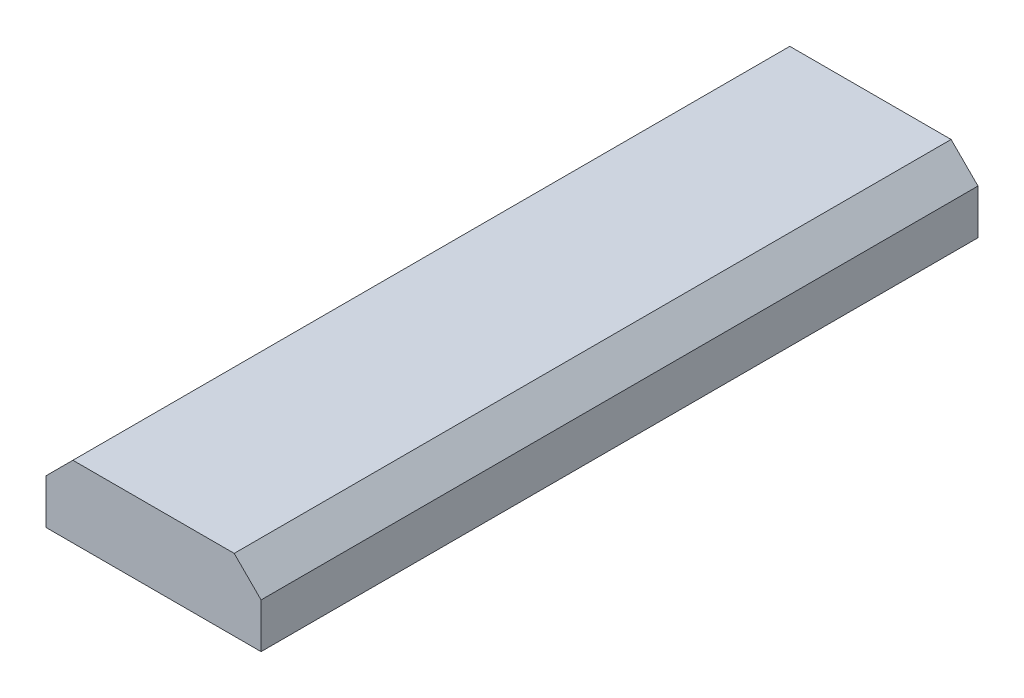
ISO-10303-21;
HEADER;
FILE_DESCRIPTION(('STEP AP214'),'2;1');
FILE_NAME('part.step','',(''),(''),'','','');
FILE_SCHEMA(('AUTOMOTIVE_DESIGN { 1 0 10303 214 1 1 1 1 }'));
ENDSEC;
DATA;
#1=APPLICATION_CONTEXT('core data for automotive mechanical design processes');
#2=APPLICATION_PROTOCOL_DEFINITION('international standard','automotive_design',2000,#1);
#3=PRODUCT_CONTEXT('',#1,'mechanical');
#4=PRODUCT('Part','Part','',(#3));
#5=PRODUCT_RELATED_PRODUCT_CATEGORY('part','',(#4));
#6=PRODUCT_DEFINITION_FORMATION('','',#4);
#7=PRODUCT_DEFINITION_CONTEXT('part definition',#1,'design');
#8=PRODUCT_DEFINITION('design','',#6,#7);
#9=PRODUCT_DEFINITION_SHAPE('','',#8);
#10=(LENGTH_UNIT() NAMED_UNIT(*) SI_UNIT(.MILLI.,.METRE.));
#11=(NAMED_UNIT(*) PLANE_ANGLE_UNIT() SI_UNIT($,.RADIAN.));
#12=(NAMED_UNIT(*) SI_UNIT($,.STERADIAN.) SOLID_ANGLE_UNIT());
#13=UNCERTAINTY_MEASURE_WITH_UNIT(LENGTH_MEASURE(1.E-05),#10,'distance_accuracy_value','');
#14=(GEOMETRIC_REPRESENTATION_CONTEXT(3) GLOBAL_UNCERTAINTY_ASSIGNED_CONTEXT((#13)) GLOBAL_UNIT_ASSIGNED_CONTEXT((#10,
#11,#12)) REPRESENTATION_CONTEXT('',''));
#15=CARTESIAN_POINT('',(0.,0.,0.));
#16=DIRECTION('',(0.,0.,1.));
#17=DIRECTION('',(1.,0.,0.));
#18=AXIS2_PLACEMENT_3D('',#15,#16,#17);
#19=CARTESIAN_POINT('',(-38.1,0.,-254.));
#20=DIRECTION('',(0.,-1.,0.));
#21=DIRECTION('',(0.,0.,-1.));
#22=AXIS2_PLACEMENT_3D('',#19,#20,#21);
#23=PLANE('',#22);
#24=DIRECTION('',(1.,0.,0.));
#25=VECTOR('',#24,1.);
#26=CARTESIAN_POINT('',(-38.1,0.,0.));
#27=LINE('',#26,#25);
#28=CARTESIAN_POINT('',(-38.1,0.,0.));
#29=VERTEX_POINT('',#28);
#30=CARTESIAN_POINT('',(38.1,0.,0.));
#31=VERTEX_POINT('',#30);
#32=EDGE_CURVE('E90',#29,#31,#27,.T.);
#33=ORIENTED_EDGE('',*,*,#32,.F.);
#34=DIRECTION('',(0.,0.,1.));
#35=VECTOR('',#34,1.);
#36=CARTESIAN_POINT('',(-38.1,0.,-254.));
#37=LINE('',#36,#35);
#38=CARTESIAN_POINT('',(-38.1,0.,-254.));
#39=VERTEX_POINT('',#38);
#40=EDGE_CURVE('E32',#39,#29,#37,.T.);
#41=ORIENTED_EDGE('',*,*,#40,.F.);
#42=DIRECTION('',(1.,0.,0.));
#43=VECTOR('',#42,1.);
#44=CARTESIAN_POINT('',(-38.1,0.,-254.));
#45=LINE('',#44,#43);
#46=CARTESIAN_POINT('',(38.1,0.,-254.));
#47=VERTEX_POINT('',#46);
#48=EDGE_CURVE('E115',#39,#47,#45,.T.);
#49=ORIENTED_EDGE('',*,*,#48,.T.);
#50=DIRECTION('',(0.,0.,1.));
#51=VECTOR('',#50,1.);
#52=CARTESIAN_POINT('',(38.1,0.,-254.));
#53=LINE('',#52,#51);
#54=EDGE_CURVE('E87',#47,#31,#53,.T.);
#55=ORIENTED_EDGE('',*,*,#54,.T.);
#56=EDGE_LOOP('',(#33,#41,#49,#55));
#57=FACE_BOUND('',#56,.T.);
#58=CARTESIAN_POINT('',(0.,0.,-203.2));
#59=DIRECTION('',(0.,-1.,0.));
#60=DIRECTION('',(0.,0.,-1.));
#61=AXIS2_PLACEMENT_3D('',#58,#59,#60);
#62=CIRCLE('',#61,7.874);
#63=CARTESIAN_POINT('',(0.,0.,-195.326));
#64=VERTEX_POINT('',#63);
#65=EDGE_CURVE('E103',#64,#64,#62,.T.);
#66=ORIENTED_EDGE('',*,*,#65,.F.);
#67=EDGE_LOOP('',(#66));
#68=FACE_BOUND('',#67,.T.);
#69=ADVANCED_FACE('F28',(#57,#68),#23,.T.);
#70=CARTESIAN_POINT('',(-38.1,0.,-254.));
#71=DIRECTION('',(-1.,0.,0.));
#72=DIRECTION('',(0.,0.,1.));
#73=AXIS2_PLACEMENT_3D('',#70,#71,#72);
#74=PLANE('',#73);
#75=DIRECTION('',(0.,-1.,0.));
#76=VECTOR('',#75,1.);
#77=CARTESIAN_POINT('',(-38.1,0.,0.));
#78=LINE('',#77,#76);
#79=CARTESIAN_POINT('',(-38.1,15.875,0.));
#80=VERTEX_POINT('',#79);
#81=EDGE_CURVE('E81',#80,#29,#78,.T.);
#82=ORIENTED_EDGE('',*,*,#81,.F.);
#83=DIRECTION('',(0.,0.,1.));
#84=VECTOR('',#83,1.);
#85=CARTESIAN_POINT('',(-38.1,15.875,-254.));
#86=LINE('',#85,#84);
#87=CARTESIAN_POINT('',(-38.1,15.875,-254.));
#88=VERTEX_POINT('',#87);
#89=EDGE_CURVE('E11',#88,#80,#86,.T.);
#90=ORIENTED_EDGE('',*,*,#89,.F.);
#91=DIRECTION('',(0.,-1.,0.));
#92=VECTOR('',#91,1.);
#93=CARTESIAN_POINT('',(-38.1,0.,-254.));
#94=LINE('',#93,#92);
#95=EDGE_CURVE('E83',#88,#39,#94,.T.);
#96=ORIENTED_EDGE('',*,*,#95,.T.);
#97=ORIENTED_EDGE('',*,*,#40,.T.);
#98=EDGE_LOOP('',(#82,#90,#96,#97));
#99=FACE_BOUND('',#98,.T.);
#100=ADVANCED_FACE('F30',(#99),#74,.T.);
#101=CARTESIAN_POINT('',(-38.1,15.875,-254.));
#102=DIRECTION('',(-0.707106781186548,0.707106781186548,0.));
#103=DIRECTION('',(-0.707106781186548,-0.707106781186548,0.));
#104=AXIS2_PLACEMENT_3D('',#101,#102,#103);
#105=PLANE('',#104);
#106=DIRECTION('',(-0.707106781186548,-0.707106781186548,0.));
#107=VECTOR('',#106,1.);
#108=CARTESIAN_POINT('',(-38.1,15.875,0.));
#109=LINE('',#108,#107);
#110=CARTESIAN_POINT('',(-28.575,25.4,0.));
#111=VERTEX_POINT('',#110);
#112=EDGE_CURVE('E99',#111,#80,#109,.T.);
#113=ORIENTED_EDGE('',*,*,#112,.F.);
#114=DIRECTION('',(0.,0.,1.));
#115=VECTOR('',#114,1.);
#116=CARTESIAN_POINT('',(-28.575,25.4,-254.));
#117=LINE('',#116,#115);
#118=CARTESIAN_POINT('',(-28.575,25.4,-254.));
#119=VERTEX_POINT('',#118);
#120=EDGE_CURVE('E37',#119,#111,#117,.T.);
#121=ORIENTED_EDGE('',*,*,#120,.F.);
#122=DIRECTION('',(-0.707106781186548,-0.707106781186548,0.));
#123=VECTOR('',#122,1.);
#124=CARTESIAN_POINT('',(-38.1,15.875,-254.));
#125=LINE('',#124,#123);
#126=EDGE_CURVE('E88',#119,#88,#125,.T.);
#127=ORIENTED_EDGE('',*,*,#126,.T.);
#128=ORIENTED_EDGE('',*,*,#89,.T.);
#129=EDGE_LOOP('',(#113,#121,#127,#128));
#130=FACE_BOUND('',#129,.T.);
#131=ADVANCED_FACE('F139',(#130),#105,.T.);
#132=CARTESIAN_POINT('',(-28.575,25.4,-254.));
#133=DIRECTION('',(0.,1.,0.));
#134=DIRECTION('',(0.,0.,1.));
#135=AXIS2_PLACEMENT_3D('',#132,#133,#134);
#136=PLANE('',#135);
#137=DIRECTION('',(-1.,0.,0.));
#138=VECTOR('',#137,1.);
#139=CARTESIAN_POINT('',(-28.575,25.4,0.));
#140=LINE('',#139,#138);
#141=CARTESIAN_POINT('',(28.575,25.4,0.));
#142=VERTEX_POINT('',#141);
#143=EDGE_CURVE('E111',#142,#111,#140,.T.);
#144=ORIENTED_EDGE('',*,*,#143,.F.);
#145=DIRECTION('',(0.,0.,1.));
#146=VECTOR('',#145,1.);
#147=CARTESIAN_POINT('',(28.575,25.4,-254.));
#148=LINE('',#147,#146);
#149=CARTESIAN_POINT('',(28.575,25.4,-254.));
#150=VERTEX_POINT('',#149);
#151=EDGE_CURVE('E127',#150,#142,#148,.T.);
#152=ORIENTED_EDGE('',*,*,#151,.F.);
#153=DIRECTION('',(-1.,0.,0.));
#154=VECTOR('',#153,1.);
#155=CARTESIAN_POINT('',(-28.575,25.4,-254.));
#156=LINE('',#155,#154);
#157=EDGE_CURVE('E123',#150,#119,#156,.T.);
#158=ORIENTED_EDGE('',*,*,#157,.T.);
#159=ORIENTED_EDGE('',*,*,#120,.T.);
#160=EDGE_LOOP('',(#144,#152,#158,#159));
#161=FACE_BOUND('',#160,.T.);
#162=ADVANCED_FACE('F144',(#161),#136,.T.);
#163=CARTESIAN_POINT('',(28.575,25.4,-254.));
#164=DIRECTION('',(0.707106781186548,0.707106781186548,0.));
#165=DIRECTION('',(-0.707106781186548,0.707106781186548,0.));
#166=AXIS2_PLACEMENT_3D('',#163,#164,#165);
#167=PLANE('',#166);
#168=DIRECTION('',(-0.707106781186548,0.707106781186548,0.));
#169=VECTOR('',#168,1.);
#170=CARTESIAN_POINT('',(28.575,25.4,0.));
#171=LINE('',#170,#169);
#172=CARTESIAN_POINT('',(38.1,15.875,0.));
#173=VERTEX_POINT('',#172);
#174=EDGE_CURVE('E108',#173,#142,#171,.T.);
#175=ORIENTED_EDGE('',*,*,#174,.F.);
#176=DIRECTION('',(0.,0.,1.));
#177=VECTOR('',#176,1.);
#178=CARTESIAN_POINT('',(38.1,15.875,-254.));
#179=LINE('',#178,#177);
#180=CARTESIAN_POINT('',(38.1,15.875,-254.));
#181=VERTEX_POINT('',#180);
#182=EDGE_CURVE('E129',#181,#173,#179,.T.);
#183=ORIENTED_EDGE('',*,*,#182,.F.);
#184=DIRECTION('',(-0.707106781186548,0.707106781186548,0.));
#185=VECTOR('',#184,1.);
#186=CARTESIAN_POINT('',(28.575,25.4,-254.));
#187=LINE('',#186,#185);
#188=EDGE_CURVE('E120',#181,#150,#187,.T.);
#189=ORIENTED_EDGE('',*,*,#188,.T.);
#190=ORIENTED_EDGE('',*,*,#151,.T.);
#191=EDGE_LOOP('',(#175,#183,#189,#190));
#192=FACE_BOUND('',#191,.T.);
#193=ADVANCED_FACE('F136',(#192),#167,.T.);
#194=CARTESIAN_POINT('',(38.1,0.,-254.));
#195=DIRECTION('',(1.,0.,0.));
#196=DIRECTION('',(0.,0.,-1.));
#197=AXIS2_PLACEMENT_3D('',#194,#195,#196);
#198=PLANE('',#197);
#199=DIRECTION('',(0.,1.,0.));
#200=VECTOR('',#199,1.);
#201=CARTESIAN_POINT('',(38.1,0.,0.));
#202=LINE('',#201,#200);
#203=EDGE_CURVE('E95',#31,#173,#202,.T.);
#204=ORIENTED_EDGE('',*,*,#203,.F.);
#205=ORIENTED_EDGE('',*,*,#54,.F.);
#206=DIRECTION('',(0.,1.,0.));
#207=VECTOR('',#206,1.);
#208=CARTESIAN_POINT('',(38.1,0.,-254.));
#209=LINE('',#208,#207);
#210=EDGE_CURVE('E117',#47,#181,#209,.T.);
#211=ORIENTED_EDGE('',*,*,#210,.T.);
#212=ORIENTED_EDGE('',*,*,#182,.T.);
#213=EDGE_LOOP('',(#204,#205,#211,#212));
#214=FACE_BOUND('',#213,.T.);
#215=ADVANCED_FACE('F132',(#214),#198,.T.);
#216=CARTESIAN_POINT('',(-38.1,25.4,-254.));
#217=DIRECTION('',(0.,0.,-1.));
#218=DIRECTION('',(-1.,0.,0.));
#219=AXIS2_PLACEMENT_3D('',#216,#217,#218);
#220=PLANE('',#219);
#221=ORIENTED_EDGE('',*,*,#95,.F.);
#222=ORIENTED_EDGE('',*,*,#126,.F.);
#223=ORIENTED_EDGE('',*,*,#157,.F.);
#224=ORIENTED_EDGE('',*,*,#188,.F.);
#225=ORIENTED_EDGE('',*,*,#210,.F.);
#226=ORIENTED_EDGE('',*,*,#48,.F.);
#227=EDGE_LOOP('',(#221,#222,#223,#224,#225,#226));
#228=FACE_BOUND('',#227,.T.);
#229=ADVANCED_FACE('F143',(#228),#220,.T.);
#230=CARTESIAN_POINT('',(-38.1,25.4,0.));
#231=DIRECTION('',(0.,0.,-1.));
#232=DIRECTION('',(-1.,0.,0.));
#233=AXIS2_PLACEMENT_3D('',#230,#231,#232);
#234=PLANE('',#233);
#235=ORIENTED_EDGE('',*,*,#81,.T.);
#236=ORIENTED_EDGE('',*,*,#32,.T.);
#237=ORIENTED_EDGE('',*,*,#203,.T.);
#238=ORIENTED_EDGE('',*,*,#174,.T.);
#239=ORIENTED_EDGE('',*,*,#143,.T.);
#240=ORIENTED_EDGE('',*,*,#112,.T.);
#241=EDGE_LOOP('',(#235,#236,#237,#238,#239,#240));
#242=FACE_BOUND('',#241,.T.);
#243=ADVANCED_FACE('F97',(#242),#234,.F.);
#244=CARTESIAN_POINT('',(0.,-9.525,-203.2));
#245=DIRECTION('',(0.,1.,0.));
#246=DIRECTION('',(0.,0.,1.));
#247=AXIS2_PLACEMENT_3D('',#244,#245,#246);
#248=CYLINDRICAL_SURFACE('',#247,7.874);
#249=CARTESIAN_POINT('',(0.,-9.525,-203.2));
#250=DIRECTION('',(0.,-1.,0.));
#251=DIRECTION('',(0.,0.,-1.));
#252=AXIS2_PLACEMENT_3D('',#249,#250,#251);
#253=CIRCLE('',#252,7.874);
#254=CARTESIAN_POINT('',(0.,-9.525,-195.326));
#255=VERTEX_POINT('',#254);
#256=EDGE_CURVE('E100',#255,#255,#253,.T.);
#257=CARTESIAN_POINT('',(0.,-9.525,-195.326));
#258=CARTESIAN_POINT('',(0.,-9.42578125,-195.326));
#259=CARTESIAN_POINT('',(0.,-9.3265625,-195.326));
#260=CARTESIAN_POINT('',(0.,-9.128125,-195.326));
#261=CARTESIAN_POINT('',(0.,-9.02890625,-195.326));
#262=CARTESIAN_POINT('',(0.,-8.83046875,-195.326));
#263=CARTESIAN_POINT('',(0.,-8.73125,-195.326));
#264=CARTESIAN_POINT('',(0.,-8.5328125,-195.326));
#265=CARTESIAN_POINT('',(0.,-8.43359375,-195.326));
#266=CARTESIAN_POINT('',(0.,-8.23515625,-195.326));
#267=CARTESIAN_POINT('',(0.,-8.1359375,-195.326));
#268=CARTESIAN_POINT('',(0.,-7.9375,-195.326));
#269=CARTESIAN_POINT('',(0.,-7.83828125,-195.326));
#270=CARTESIAN_POINT('',(0.,-7.63984375,-195.326));
#271=CARTESIAN_POINT('',(0.,-7.540625,-195.326));
#272=CARTESIAN_POINT('',(0.,-7.3421875,-195.326));
#273=CARTESIAN_POINT('',(0.,-7.24296875,-195.326));
#274=CARTESIAN_POINT('',(0.,-7.04453125,-195.326));
#275=CARTESIAN_POINT('',(0.,-6.9453125,-195.326));
#276=CARTESIAN_POINT('',(0.,-6.746875,-195.326));
#277=CARTESIAN_POINT('',(0.,-6.64765625,-195.326));
#278=CARTESIAN_POINT('',(0.,-6.44921875,-195.326));
#279=CARTESIAN_POINT('',(0.,-6.35,-195.326));
#280=CARTESIAN_POINT('',(0.,-6.1515625,-195.326));
#281=CARTESIAN_POINT('',(0.,-6.05234375,-195.326));
#282=CARTESIAN_POINT('',(0.,-5.85390625,-195.326));
#283=CARTESIAN_POINT('',(0.,-5.7546875,-195.326));
#284=CARTESIAN_POINT('',(0.,-5.55625,-195.326));
#285=CARTESIAN_POINT('',(0.,-5.45703125,-195.326));
#286=CARTESIAN_POINT('',(0.,-5.25859375,-195.326));
#287=CARTESIAN_POINT('',(0.,-5.159375,-195.326));
#288=CARTESIAN_POINT('',(0.,-4.9609375,-195.326));
#289=CARTESIAN_POINT('',(0.,-4.86171875,-195.326));
#290=CARTESIAN_POINT('',(0.,-4.66328125,-195.326));
#291=CARTESIAN_POINT('',(0.,-4.5640625,-195.326));
#292=CARTESIAN_POINT('',(0.,-4.365625,-195.326));
#293=CARTESIAN_POINT('',(0.,-4.26640625,-195.326));
#294=CARTESIAN_POINT('',(0.,-4.06796875,-195.326));
#295=CARTESIAN_POINT('',(0.,-3.96875,-195.326));
#296=CARTESIAN_POINT('',(0.,-3.7703125,-195.326));
#297=CARTESIAN_POINT('',(0.,-3.67109375,-195.326));
#298=CARTESIAN_POINT('',(0.,-3.47265625,-195.326));
#299=CARTESIAN_POINT('',(0.,-3.3734375,-195.326));
#300=CARTESIAN_POINT('',(0.,-3.175,-195.326));
#301=CARTESIAN_POINT('',(0.,-3.07578125,-195.326));
#302=CARTESIAN_POINT('',(0.,-2.87734375,-195.326));
#303=CARTESIAN_POINT('',(0.,-2.778125,-195.326));
#304=CARTESIAN_POINT('',(0.,-2.5796875,-195.326));
#305=CARTESIAN_POINT('',(0.,-2.48046875,-195.326));
#306=CARTESIAN_POINT('',(0.,-2.28203125,-195.326));
#307=CARTESIAN_POINT('',(0.,-2.1828125,-195.326));
#308=CARTESIAN_POINT('',(0.,-1.984375,-195.326));
#309=CARTESIAN_POINT('',(0.,-1.88515625,-195.326));
#310=CARTESIAN_POINT('',(0.,-1.68671875,-195.326));
#311=CARTESIAN_POINT('',(0.,-1.5875,-195.326));
#312=CARTESIAN_POINT('',(0.,-1.3890625,-195.326));
#313=CARTESIAN_POINT('',(0.,-1.28984375,-195.326));
#314=CARTESIAN_POINT('',(0.,-1.09140625,-195.326));
#315=CARTESIAN_POINT('',(0.,-0.992187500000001,-195.326));
#316=CARTESIAN_POINT('',(0.,-0.793750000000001,-195.326));
#317=CARTESIAN_POINT('',(0.,-0.69453125,-195.326));
#318=CARTESIAN_POINT('',(0.,-0.49609375,-195.326));
#319=CARTESIAN_POINT('',(0.,-0.396875,-195.326));
#320=CARTESIAN_POINT('',(0.,-0.1984375,-195.326));
#321=CARTESIAN_POINT('',(0.,-0.0992187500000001,-195.326));
#322=CARTESIAN_POINT('',(0.,0.,-195.326));
#323=B_SPLINE_CURVE_WITH_KNOTS('',3,(#257,#258,#259,#260,#261,#262,#263,#264,#265,#266,#267,
#268,#269,#270,#271,#272,#273,#274,#275,#276,#277,#278,#279,#280,#281,#282,#283,#284,#285,#286,
#287,#288,#289,#290,#291,#292,#293,#294,#295,#296,#297,#298,#299,#300,#301,#302,#303,#304,#305,
#306,#307,#308,#309,#310,#311,#312,#313,#314,#315,#316,#317,#318,#319,#320,#321,#322),
.UNSPECIFIED.,.F.,.F.,(4,2,2,2,2,2,2,2,2,2,2,2,2,2,2,2,2,2,2,2,2,2,2,2,2,2,2,2,2,2,2,2,4),(0.,
0.297656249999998,0.595312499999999,0.892968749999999,1.190625,1.48828125,1.7859375,2.08359375,
2.38125,2.67890625,2.9765625,3.27421875,3.571875,3.86953125,4.1671875,4.46484375,4.7625,
5.06015625,5.3578125,5.65546875,5.953125,6.25078125,6.5484375,6.84609375,7.14375,7.44140625,
7.7390625,8.03671875,8.334375,8.63203125,8.9296875,9.22734375,9.525),.UNSPECIFIED.);
#324=EDGE_CURVE('BSEAM167',#255,#64,#323,.T.);
#325=ORIENTED_EDGE('',*,*,#256,.F.);
#326=ORIENTED_EDGE('',*,*,#65,.T.);
#327=ORIENTED_EDGE('',*,*,#324,.T.);
#328=ORIENTED_EDGE('',*,*,#324,.F.);
#329=EDGE_LOOP('',(#325,#327,#326,#328));
#330=FACE_BOUND('',#329,.T.);
#331=ADVANCED_FACE('F167',(#330),#248,.T.);
#332=CARTESIAN_POINT('',(0.,-9.525,-203.2));
#333=DIRECTION('',(0.,-1.,0.));
#334=DIRECTION('',(0.,0.,-1.));
#335=AXIS2_PLACEMENT_3D('',#332,#333,#334);
#336=PLANE('',#335);
#337=ORIENTED_EDGE('',*,*,#256,.T.);
#338=EDGE_LOOP('',(#337));
#339=FACE_BOUND('',#338,.T.);
#340=ADVANCED_FACE('F171',(#339),#336,.T.);
#341=CLOSED_SHELL('',(#69,#100,#131,#162,#193,#215,#229,#243,#331,#340));
#342=MANIFOLD_SOLID_BREP('B2',#341);
#343=ADVANCED_BREP_SHAPE_REPRESENTATION('',(#18,#342),#14);
#344=SHAPE_DEFINITION_REPRESENTATION(#9,#343);
ENDSEC;
END-ISO-10303-21;
